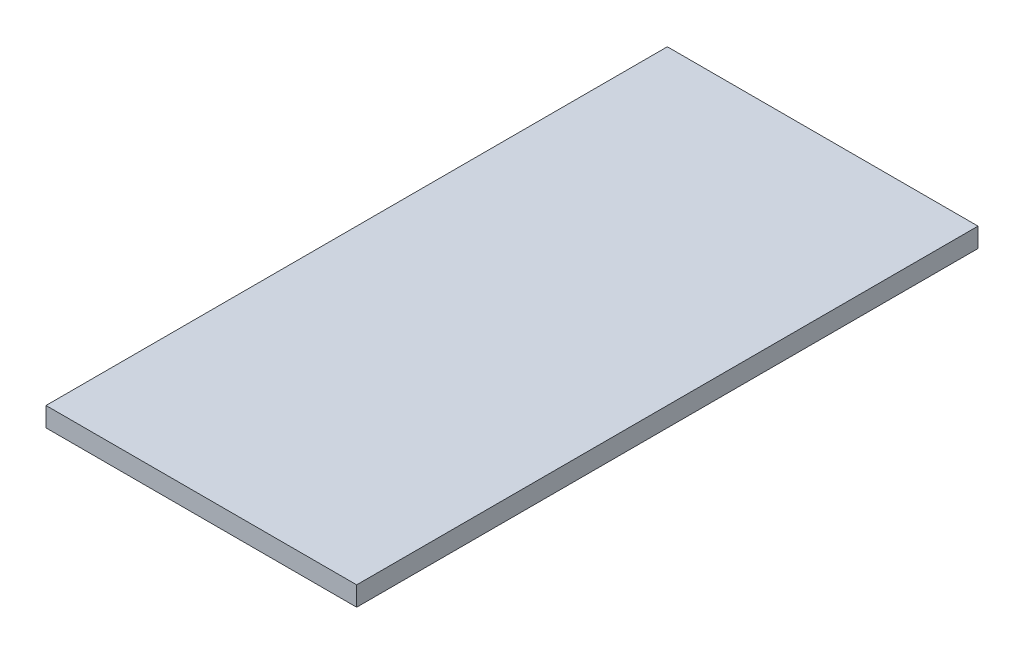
ISO-10303-21;
HEADER;
FILE_DESCRIPTION(('STEP AP214'),'2;1');
FILE_NAME('part.step','',(''),(''),'','','');
FILE_SCHEMA(('AUTOMOTIVE_DESIGN { 1 0 10303 214 1 1 1 1 }'));
ENDSEC;
DATA;
#1=APPLICATION_CONTEXT('core data for automotive mechanical design processes');
#2=APPLICATION_PROTOCOL_DEFINITION('international standard','automotive_design',2000,#1);
#3=PRODUCT_CONTEXT('',#1,'mechanical');
#4=PRODUCT('Part','Part','',(#3));
#5=PRODUCT_RELATED_PRODUCT_CATEGORY('part','',(#4));
#6=PRODUCT_DEFINITION_FORMATION('','',#4);
#7=PRODUCT_DEFINITION_CONTEXT('part definition',#1,'design');
#8=PRODUCT_DEFINITION('design','',#6,#7);
#9=PRODUCT_DEFINITION_SHAPE('','',#8);
#10=(LENGTH_UNIT() NAMED_UNIT(*) SI_UNIT(.MILLI.,.METRE.));
#11=(NAMED_UNIT(*) PLANE_ANGLE_UNIT() SI_UNIT($,.RADIAN.));
#12=(NAMED_UNIT(*) SI_UNIT($,.STERADIAN.) SOLID_ANGLE_UNIT());
#13=UNCERTAINTY_MEASURE_WITH_UNIT(LENGTH_MEASURE(1.E-05),#10,'distance_accuracy_value','');
#14=(GEOMETRIC_REPRESENTATION_CONTEXT(3) GLOBAL_UNCERTAINTY_ASSIGNED_CONTEXT((#13)) GLOBAL_UNIT_ASSIGNED_CONTEXT((#10,
#11,#12)) REPRESENTATION_CONTEXT('',''));
#15=CARTESIAN_POINT('',(0.,0.,0.));
#16=DIRECTION('',(0.,0.,1.));
#17=DIRECTION('',(1.,0.,0.));
#18=AXIS2_PLACEMENT_3D('',#15,#16,#17);
#19=CARTESIAN_POINT('',(0.,0.,609.6));
#20=DIRECTION('',(1.,0.,0.));
#21=DIRECTION('',(0.,0.,-1.));
#22=AXIS2_PLACEMENT_3D('',#19,#20,#21);
#23=PLANE('',#22);
#24=DIRECTION('',(0.,-1.,0.));
#25=VECTOR('',#24,1.);
#26=CARTESIAN_POINT('',(0.,0.,0.));
#27=LINE('',#26,#25);
#28=CARTESIAN_POINT('',(0.,19.05,0.));
#29=VERTEX_POINT('',#28);
#30=CARTESIAN_POINT('',(0.,0.,0.));
#31=VERTEX_POINT('',#30);
#32=EDGE_CURVE('E95',#29,#31,#27,.T.);
#33=ORIENTED_EDGE('',*,*,#32,.T.);
#34=DIRECTION('',(0.,0.,-1.));
#35=VECTOR('',#34,1.);
#36=CARTESIAN_POINT('',(0.,0.,609.6));
#37=LINE('',#36,#35);
#38=CARTESIAN_POINT('',(0.,0.,609.6));
#39=VERTEX_POINT('',#38);
#40=EDGE_CURVE('E11',#39,#31,#37,.T.);
#41=ORIENTED_EDGE('',*,*,#40,.F.);
#42=DIRECTION('',(0.,-1.,0.));
#43=VECTOR('',#42,1.);
#44=CARTESIAN_POINT('',(0.,0.,609.6));
#45=LINE('',#44,#43);
#46=CARTESIAN_POINT('',(0.,19.05,609.6));
#47=VERTEX_POINT('',#46);
#48=EDGE_CURVE('E83',#47,#39,#45,.T.);
#49=ORIENTED_EDGE('',*,*,#48,.F.);
#50=DIRECTION('',(0.,0.,-1.));
#51=VECTOR('',#50,1.);
#52=CARTESIAN_POINT('',(0.,19.05,609.6));
#53=LINE('',#52,#51);
#54=EDGE_CURVE('E91',#47,#29,#53,.T.);
#55=ORIENTED_EDGE('',*,*,#54,.T.);
#56=EDGE_LOOP('',(#33,#41,#49,#55));
#57=FACE_BOUND('',#56,.T.);
#58=ADVANCED_FACE('F32',(#57),#23,.F.);
#59=CARTESIAN_POINT('',(0.,0.,609.6));
#60=DIRECTION('',(0.,1.,0.));
#61=DIRECTION('',(0.,0.,1.));
#62=AXIS2_PLACEMENT_3D('',#59,#60,#61);
#63=PLANE('',#62);
#64=DIRECTION('',(1.,0.,0.));
#65=VECTOR('',#64,1.);
#66=CARTESIAN_POINT('',(0.,0.,0.));
#67=LINE('',#66,#65);
#68=CARTESIAN_POINT('',(304.8,0.,0.));
#69=VERTEX_POINT('',#68);
#70=EDGE_CURVE('E87',#31,#69,#67,.T.);
#71=ORIENTED_EDGE('',*,*,#70,.T.);
#72=DIRECTION('',(0.,0.,-1.));
#73=VECTOR('',#72,1.);
#74=CARTESIAN_POINT('',(304.8,0.,609.6));
#75=LINE('',#74,#73);
#76=CARTESIAN_POINT('',(304.8,0.,609.6));
#77=VERTEX_POINT('',#76);
#78=EDGE_CURVE('E40',#77,#69,#75,.T.);
#79=ORIENTED_EDGE('',*,*,#78,.F.);
#80=DIRECTION('',(1.,0.,0.));
#81=VECTOR('',#80,1.);
#82=CARTESIAN_POINT('',(0.,0.,609.6));
#83=LINE('',#82,#81);
#84=EDGE_CURVE('E78',#39,#77,#83,.T.);
#85=ORIENTED_EDGE('',*,*,#84,.F.);
#86=ORIENTED_EDGE('',*,*,#40,.T.);
#87=EDGE_LOOP('',(#71,#79,#85,#86));
#88=FACE_BOUND('',#87,.T.);
#89=ADVANCED_FACE('F86',(#88),#63,.F.);
#90=CARTESIAN_POINT('',(304.8,0.,609.6));
#91=DIRECTION('',(-1.,0.,0.));
#92=DIRECTION('',(0.,0.,1.));
#93=AXIS2_PLACEMENT_3D('',#90,#91,#92);
#94=PLANE('',#93);
#95=DIRECTION('',(0.,1.,0.));
#96=VECTOR('',#95,1.);
#97=CARTESIAN_POINT('',(304.8,0.,0.));
#98=LINE('',#97,#96);
#99=CARTESIAN_POINT('',(304.8,19.05,0.));
#100=VERTEX_POINT('',#99);
#101=EDGE_CURVE('E65',#69,#100,#98,.T.);
#102=ORIENTED_EDGE('',*,*,#101,.T.);
#103=DIRECTION('',(0.,0.,-1.));
#104=VECTOR('',#103,1.);
#105=CARTESIAN_POINT('',(304.8,19.05,609.6));
#106=LINE('',#105,#104);
#107=CARTESIAN_POINT('',(304.8,19.05,609.6));
#108=VERTEX_POINT('',#107);
#109=EDGE_CURVE('E88',#108,#100,#106,.T.);
#110=ORIENTED_EDGE('',*,*,#109,.F.);
#111=DIRECTION('',(0.,1.,0.));
#112=VECTOR('',#111,1.);
#113=CARTESIAN_POINT('',(304.8,0.,609.6));
#114=LINE('',#113,#112);
#115=EDGE_CURVE('E81',#77,#108,#114,.T.);
#116=ORIENTED_EDGE('',*,*,#115,.F.);
#117=ORIENTED_EDGE('',*,*,#78,.T.);
#118=EDGE_LOOP('',(#102,#110,#116,#117));
#119=FACE_BOUND('',#118,.T.);
#120=ADVANCED_FACE('F89',(#119),#94,.F.);
#121=CARTESIAN_POINT('',(0.,19.05,609.6));
#122=DIRECTION('',(0.,-1.,0.));
#123=DIRECTION('',(0.,0.,-1.));
#124=AXIS2_PLACEMENT_3D('',#121,#122,#123);
#125=PLANE('',#124);
#126=DIRECTION('',(-1.,0.,0.));
#127=VECTOR('',#126,1.);
#128=CARTESIAN_POINT('',(0.,19.05,0.));
#129=LINE('',#128,#127);
#130=EDGE_CURVE('E71',#100,#29,#129,.T.);
#131=ORIENTED_EDGE('',*,*,#130,.T.);
#132=ORIENTED_EDGE('',*,*,#54,.F.);
#133=DIRECTION('',(-1.,0.,0.));
#134=VECTOR('',#133,1.);
#135=CARTESIAN_POINT('',(0.,19.05,609.6));
#136=LINE('',#135,#134);
#137=EDGE_CURVE('E48',#108,#47,#136,.T.);
#138=ORIENTED_EDGE('',*,*,#137,.F.);
#139=ORIENTED_EDGE('',*,*,#109,.T.);
#140=EDGE_LOOP('',(#131,#132,#138,#139));
#141=FACE_BOUND('',#140,.T.);
#142=ADVANCED_FACE('F102',(#141),#125,.F.);
#143=CARTESIAN_POINT('',(0.,19.05,609.6));
#144=DIRECTION('',(0.,0.,-1.));
#145=DIRECTION('',(-1.,0.,0.));
#146=AXIS2_PLACEMENT_3D('',#143,#144,#145);
#147=PLANE('',#146);
#148=ORIENTED_EDGE('',*,*,#48,.T.);
#149=ORIENTED_EDGE('',*,*,#84,.T.);
#150=ORIENTED_EDGE('',*,*,#115,.T.);
#151=ORIENTED_EDGE('',*,*,#137,.T.);
#152=EDGE_LOOP('',(#148,#149,#150,#151));
#153=FACE_BOUND('',#152,.T.);
#154=ADVANCED_FACE('F79',(#153),#147,.F.);
#155=CARTESIAN_POINT('',(0.,19.05,0.));
#156=DIRECTION('',(0.,0.,-1.));
#157=DIRECTION('',(-1.,0.,0.));
#158=AXIS2_PLACEMENT_3D('',#155,#156,#157);
#159=PLANE('',#158);
#160=ORIENTED_EDGE('',*,*,#32,.F.);
#161=ORIENTED_EDGE('',*,*,#130,.F.);
#162=ORIENTED_EDGE('',*,*,#101,.F.);
#163=ORIENTED_EDGE('',*,*,#70,.F.);
#164=EDGE_LOOP('',(#160,#161,#162,#163));
#165=FACE_BOUND('',#164,.T.);
#166=ADVANCED_FACE('F105',(#165),#159,.T.);
#167=CLOSED_SHELL('',(#58,#89,#120,#142,#154,#166));
#168=MANIFOLD_SOLID_BREP('B2',#167);
#169=ADVANCED_BREP_SHAPE_REPRESENTATION('',(#18,#168),#14);
#170=SHAPE_DEFINITION_REPRESENTATION(#9,#169);
ENDSEC;
END-ISO-10303-21;
